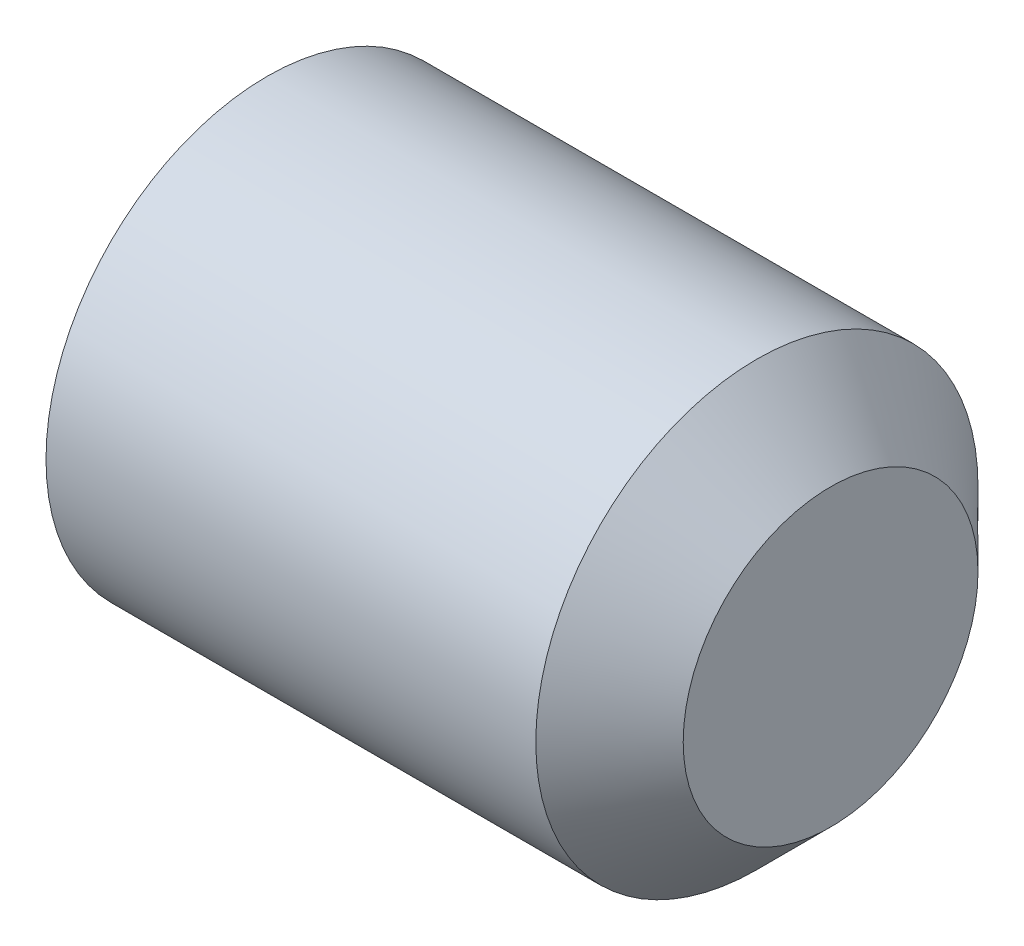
ISO-10303-21;
HEADER;
FILE_DESCRIPTION(('STEP AP214'),'2;1');
FILE_NAME('part.step','',(''),(''),'','','');
FILE_SCHEMA(('AUTOMOTIVE_DESIGN { 1 0 10303 214 1 1 1 1 }'));
ENDSEC;
DATA;
#1=APPLICATION_CONTEXT('core data for automotive mechanical design processes');
#2=APPLICATION_PROTOCOL_DEFINITION('international standard','automotive_design',2000,#1);
#3=PRODUCT_CONTEXT('',#1,'mechanical');
#4=PRODUCT('Part','Part','',(#3));
#5=PRODUCT_RELATED_PRODUCT_CATEGORY('part','',(#4));
#6=PRODUCT_DEFINITION_FORMATION('','',#4);
#7=PRODUCT_DEFINITION_CONTEXT('part definition',#1,'design');
#8=PRODUCT_DEFINITION('design','',#6,#7);
#9=PRODUCT_DEFINITION_SHAPE('','',#8);
#10=(LENGTH_UNIT() NAMED_UNIT(*) SI_UNIT(.MILLI.,.METRE.));
#11=(NAMED_UNIT(*) PLANE_ANGLE_UNIT() SI_UNIT($,.RADIAN.));
#12=(NAMED_UNIT(*) SI_UNIT($,.STERADIAN.) SOLID_ANGLE_UNIT());
#13=UNCERTAINTY_MEASURE_WITH_UNIT(LENGTH_MEASURE(1.E-05),#10,'distance_accuracy_value','');
#14=(GEOMETRIC_REPRESENTATION_CONTEXT(3) GLOBAL_UNCERTAINTY_ASSIGNED_CONTEXT((#13)) GLOBAL_UNIT_ASSIGNED_CONTEXT((#10,
#11,#12)) REPRESENTATION_CONTEXT('',''));
#15=CARTESIAN_POINT('',(0.,0.,0.));
#16=DIRECTION('',(0.,0.,1.));
#17=DIRECTION('',(1.,0.,0.));
#18=AXIS2_PLACEMENT_3D('',#15,#16,#17);
#19=CARTESIAN_POINT('',(0.,0.,0.));
#20=DIRECTION('',(-1.,0.,0.));
#21=DIRECTION('',(0.,0.,1.));
#22=AXIS2_PLACEMENT_3D('',#19,#20,#21);
#23=CONICAL_SURFACE('',#22,1.7320508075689,1.0471975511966);
#24=CARTESIAN_POINT('',(-1.48566055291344E-11,-4.45691660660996E-11,1.73205080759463));
#25=CARTESIAN_POINT('',(0.0435225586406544,0.130567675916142,1.65666752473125));
#26=CARTESIAN_POINT('',(0.0790805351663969,0.262596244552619,1.58044079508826));
#27=CARTESIAN_POINT('',(0.126101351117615,0.531650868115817,1.42510203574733));
#28=CARTESIAN_POINT('',(0.136966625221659,0.666918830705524,1.34700504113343));
#29=CARTESIAN_POINT('',(0.13002522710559,0.921354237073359,1.20010669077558));
#30=CARTESIAN_POINT('',(0.115926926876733,1.0388521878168,1.13226921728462));
#31=CARTESIAN_POINT('',(0.0696548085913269,1.2718608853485,0.997741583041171));
#32=CARTESIAN_POINT('',(0.0378293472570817,1.3865119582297,0.93154775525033));
#33=CARTESIAN_POINT('',(-2.64892274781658E-12,1.50000000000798,0.866025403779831));
#34=B_SPLINE_CURVE_WITH_KNOTS('',3,(#24,#25,#26,#27,#28,#29,#30,#31,#32,#33),.UNSPECIFIED.,.F.,
.F.,(4,2,2,2,4),(0.000238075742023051,0.468729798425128,0.937221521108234,1.34337114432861,
1.74952076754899),.UNSPECIFIED.);
#35=CARTESIAN_POINT('',(0.,0.,1.7320508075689));
#36=VERTEX_POINT('',#35);
#37=CARTESIAN_POINT('',(0.,1.5,0.866025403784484));
#38=VERTEX_POINT('',#37);
#39=EDGE_CURVE('E4',#36,#38,#34,.T.);
#40=ORIENTED_EDGE('',*,*,#39,.F.);
#41=CARTESIAN_POINT('',(0.,0.,0.));
#42=DIRECTION('',(-1.,0.,0.));
#43=DIRECTION('',(0.,0.,1.));
#44=AXIS2_PLACEMENT_3D('',#41,#42,#43);
#45=CIRCLE('',#44,1.7320508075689);
#46=EDGE_CURVE('E22',#36,#38,#45,.T.);
#47=ORIENTED_EDGE('',*,*,#46,.T.);
#48=EDGE_LOOP('',(#40,#47));
#49=FACE_BOUND('',#48,.T.);
#50=ADVANCED_FACE('F27',(#49),#23,.F.);
#51=CARTESIAN_POINT('',(-8.51055337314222E-12,-1.50000000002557,0.866025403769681));
#52=CARTESIAN_POINT('',(0.0435225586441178,-1.36943232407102,0.941408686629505));
#53=CARTESIAN_POINT('',(0.0790805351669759,-1.23740375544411,1.01763541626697));
#54=CARTESIAN_POINT('',(0.126101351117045,-0.968349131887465,1.17297417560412));
#55=CARTESIAN_POINT('',(0.13696662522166,-0.833081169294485,1.25107117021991));
#56=CARTESIAN_POINT('',(0.130025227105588,-0.578645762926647,1.39796952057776));
#57=CARTESIAN_POINT('',(0.115926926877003,-0.461147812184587,1.46580699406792));
#58=CARTESIAN_POINT('',(0.0696548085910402,-0.228139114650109,1.60033462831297));
#59=CARTESIAN_POINT('',(0.0378293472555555,-0.113488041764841,1.66652845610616));
#60=CARTESIAN_POINT('',(-5.35986185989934E-12,1.60769959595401E-11,1.73205080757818));
#61=B_SPLINE_CURVE_WITH_KNOTS('',3,(#51,#52,#53,#54,#55,#56,#57,#58,#59,#60),.UNSPECIFIED.,.F.,
.F.,(4,2,2,2,4),(0.000238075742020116,0.468729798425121,0.937221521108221,1.34337114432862,
1.74952076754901),.UNSPECIFIED.);
#62=CARTESIAN_POINT('',(0.,-1.5,0.86602540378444));
#63=VERTEX_POINT('',#62);
#64=EDGE_CURVE('E37',#63,#36,#61,.T.);
#65=ORIENTED_EDGE('',*,*,#64,.F.);
#66=CARTESIAN_POINT('',(0.,0.,0.));
#67=DIRECTION('',(-1.,0.,0.));
#68=DIRECTION('',(0.,-0.866025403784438,0.500000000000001));
#69=AXIS2_PLACEMENT_3D('',#66,#67,#68);
#70=CIRCLE('',#69,1.7320508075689);
#71=EDGE_CURVE('E54',#63,#36,#70,.T.);
#72=ORIENTED_EDGE('',*,*,#71,.T.);
#73=EDGE_LOOP('',(#65,#72));
#74=FACE_BOUND('',#73,.T.);
#75=ADVANCED_FACE('F57',(#74),#23,.F.);
#76=CARTESIAN_POINT('',(-6.69702227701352E-09,-1.5,-0.866025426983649));
#77=CARTESIAN_POINT('',(0.0362442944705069,-1.5,-0.740471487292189));
#78=CARTESIAN_POINT('',(0.0669200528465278,-1.5,-0.614005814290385));
#79=CARTESIAN_POINT('',(0.112772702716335,-1.5,-0.355816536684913));
#80=CARTESIAN_POINT('',(0.12756856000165,-1.5,-0.224922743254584));
#81=CARTESIAN_POINT('',(0.138151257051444,-1.5,0.0694141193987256));
#82=CARTESIAN_POINT('',(0.12829070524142,-1.5,0.231850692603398));
#83=CARTESIAN_POINT('',(0.0931037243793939,-1.5,0.472666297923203));
#84=CARTESIAN_POINT('',(0.0782293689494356,-1.5,0.551613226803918));
#85=CARTESIAN_POINT('',(0.0517420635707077,-1.5,0.670002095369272));
#86=CARTESIAN_POINT('',(0.0422352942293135,-1.5,0.709346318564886));
#87=CARTESIAN_POINT('',(0.0270622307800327,-1.5,0.76820038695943));
#88=CARTESIAN_POINT('',(0.0218485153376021,-1.5,0.787805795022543));
#89=CARTESIAN_POINT('',(0.0138153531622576,-1.5,0.817162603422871));
#90=CARTESIAN_POINT('',(0.0111005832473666,-1.5,0.826945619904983));
#91=CARTESIAN_POINT('',(0.00560150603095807,-1.5,0.846497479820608));
#92=CARTESIAN_POINT('',(0.00281568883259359,-1.5,0.856271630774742));
#93=CARTESIAN_POINT('',(-2.02321907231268E-06,-1.5,0.866032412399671));
#94=B_SPLINE_CURVE_WITH_KNOTS('',3,(#76,#77,#78,#79,#80,#81,#82,#83,#84,#85,#86,#87,#88,#89,#90,
#91,#92,#93),.UNSPECIFIED.,.F.,.F.,(4,2,2,2,2,2,2,2,4),(2.18200322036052,2.57545986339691,
2.9689165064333,3.45728259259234,3.70146563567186,3.82355715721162,3.8846029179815,
3.91512579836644,3.94564867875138),.UNSPECIFIED.);
#95=CARTESIAN_POINT('',(0.,-1.5,-0.86602540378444));
#96=VERTEX_POINT('',#95);
#97=EDGE_CURVE('E63',#96,#63,#94,.T.);
#98=ORIENTED_EDGE('',*,*,#97,.F.);
#99=CARTESIAN_POINT('',(0.,0.,0.));
#100=DIRECTION('',(-1.,0.,0.));
#101=DIRECTION('',(0.,-0.866025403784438,-0.500000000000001));
#102=AXIS2_PLACEMENT_3D('',#99,#100,#101);
#103=CIRCLE('',#102,1.7320508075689);
#104=EDGE_CURVE('E80',#96,#63,#103,.T.);
#105=ORIENTED_EDGE('',*,*,#104,.T.);
#106=EDGE_LOOP('',(#98,#105));
#107=FACE_BOUND('',#106,.T.);
#108=ADVANCED_FACE('F83',(#107),#23,.F.);
#109=CARTESIAN_POINT('',(-8.52096171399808E-12,2.55633188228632E-11,-1.73205080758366));
#110=CARTESIAN_POINT('',(0.0435225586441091,-0.130567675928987,-1.65666752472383));
#111=CARTESIAN_POINT('',(0.0790805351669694,-0.262596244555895,-1.58044079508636));
#112=CARTESIAN_POINT('',(0.126101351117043,-0.531650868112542,-1.42510203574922));
#113=CARTESIAN_POINT('',(0.13696662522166,-0.666918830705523,-1.34700504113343));
#114=CARTESIAN_POINT('',(0.13002522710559,-0.921354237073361,-1.20010669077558));
#115=CARTESIAN_POINT('',(0.115926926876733,-1.0388521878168,-1.13226921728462));
#116=CARTESIAN_POINT('',(0.0696548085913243,-1.27186088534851,-0.997741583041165));
#117=CARTESIAN_POINT('',(0.0378293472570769,-1.38651195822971,-0.931547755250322));
#118=CARTESIAN_POINT('',(-2.6549942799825E-12,-1.500000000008,-0.866025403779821));
#119=B_SPLINE_CURVE_WITH_KNOTS('',3,(#109,#110,#111,#112,#113,#114,#115,#116,#117,#118),
.UNSPECIFIED.,.F.,.F.,(4,2,2,2,4),(0.000238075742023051,0.468729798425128,0.937221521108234,
1.34337114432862,1.74952076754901),.UNSPECIFIED.);
#120=CARTESIAN_POINT('',(0.,0.,-1.7320508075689));
#121=VERTEX_POINT('',#120);
#122=EDGE_CURVE('E89',#121,#96,#119,.T.);
#123=ORIENTED_EDGE('',*,*,#122,.F.);
#124=CARTESIAN_POINT('',(0.,0.,0.));
#125=DIRECTION('',(-1.,0.,0.));
#126=DIRECTION('',(0.,0.,-1.));
#127=AXIS2_PLACEMENT_3D('',#124,#125,#126);
#128=CIRCLE('',#127,1.7320508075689);
#129=EDGE_CURVE('E106',#121,#96,#128,.T.);
#130=ORIENTED_EDGE('',*,*,#129,.T.);
#131=EDGE_LOOP('',(#123,#130));
#132=FACE_BOUND('',#131,.T.);
#133=ADVANCED_FACE('F109',(#132),#23,.F.);
#134=CARTESIAN_POINT('',(-8.51055337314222E-12,1.50000000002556,-0.866025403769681));
#135=CARTESIAN_POINT('',(0.0435225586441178,1.36943232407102,-0.941408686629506));
#136=CARTESIAN_POINT('',(0.0790805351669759,1.23740375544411,-1.01763541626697));
#137=CARTESIAN_POINT('',(0.126101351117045,0.968349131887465,-1.17297417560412));
#138=CARTESIAN_POINT('',(0.13696662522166,0.833081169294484,-1.25107117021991));
#139=CARTESIAN_POINT('',(0.130025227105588,0.578645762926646,-1.39796952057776));
#140=CARTESIAN_POINT('',(0.115926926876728,0.461147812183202,-1.46580699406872));
#141=CARTESIAN_POINT('',(0.0696548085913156,0.228139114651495,-1.60033462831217));
#142=CARTESIAN_POINT('',(0.0378293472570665,0.113488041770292,-1.66652845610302));
#143=CARTESIAN_POINT('',(-2.66713734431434E-12,-7.99926954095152E-12,-1.73205080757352));
#144=B_SPLINE_CURVE_WITH_KNOTS('',3,(#134,#135,#136,#137,#138,#139,#140,#141,#142,#143),
.UNSPECIFIED.,.F.,.F.,(4,2,2,2,4),(0.000238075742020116,0.468729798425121,0.937221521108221,
1.34337114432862,1.74952076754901),.UNSPECIFIED.);
#145=CARTESIAN_POINT('',(0.,1.5,-0.86602540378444));
#146=VERTEX_POINT('',#145);
#147=EDGE_CURVE('E115',#146,#121,#144,.T.);
#148=ORIENTED_EDGE('',*,*,#147,.F.);
#149=CARTESIAN_POINT('',(0.,0.,0.));
#150=DIRECTION('',(-1.,0.,0.));
#151=DIRECTION('',(0.,0.866025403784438,-0.500000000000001));
#152=AXIS2_PLACEMENT_3D('',#149,#150,#151);
#153=CIRCLE('',#152,1.7320508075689);
#154=EDGE_CURVE('E132',#146,#121,#153,.T.);
#155=ORIENTED_EDGE('',*,*,#154,.T.);
#156=EDGE_LOOP('',(#148,#155));
#157=FACE_BOUND('',#156,.T.);
#158=ADVANCED_FACE('F135',(#157),#23,.F.);
#159=CARTESIAN_POINT('',(-6.69703442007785E-09,1.5,0.866025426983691));
#160=CARTESIAN_POINT('',(0.0362442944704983,1.5,0.740471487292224));
#161=CARTESIAN_POINT('',(0.0669200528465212,1.5,0.614005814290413));
#162=CARTESIAN_POINT('',(0.112772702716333,1.5,0.355816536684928));
#163=CARTESIAN_POINT('',(0.12756856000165,1.5,0.224922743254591));
#164=CARTESIAN_POINT('',(0.138151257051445,1.5,-0.0694141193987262));
#165=CARTESIAN_POINT('',(0.12829070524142,1.5,-0.231850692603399));
#166=CARTESIAN_POINT('',(0.0931037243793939,1.5,-0.472666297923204));
#167=CARTESIAN_POINT('',(0.0782293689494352,1.5,-0.551613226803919));
#168=CARTESIAN_POINT('',(0.0517420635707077,1.5,-0.670002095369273));
#169=CARTESIAN_POINT('',(0.0422352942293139,1.5,-0.709346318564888));
#170=CARTESIAN_POINT('',(0.0270622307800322,1.5,-0.768200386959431));
#171=CARTESIAN_POINT('',(0.0218485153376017,1.5,-0.787805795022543));
#172=CARTESIAN_POINT('',(0.0138153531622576,1.5,-0.817162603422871));
#173=CARTESIAN_POINT('',(0.0111005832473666,1.5,-0.826945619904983));
#174=CARTESIAN_POINT('',(0.00560150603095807,1.5,-0.846497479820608));
#175=CARTESIAN_POINT('',(0.00281568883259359,1.5,-0.856271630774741));
#176=CARTESIAN_POINT('',(-2.02321907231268E-06,1.5,-0.86603241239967));
#177=B_SPLINE_CURVE_WITH_KNOTS('',3,(#159,#160,#161,#162,#163,#164,#165,#166,#167,#168,#169,
#170,#171,#172,#173,#174,#175,#176),.UNSPECIFIED.,.F.,.F.,(4,2,2,2,2,2,2,2,4),(2.18200322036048,
2.57545986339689,2.9689165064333,3.45728259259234,3.70146563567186,3.82355715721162,
3.8846029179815,3.91512579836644,3.94564867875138),.UNSPECIFIED.);
#178=EDGE_CURVE('E141',#38,#146,#177,.T.);
#179=ORIENTED_EDGE('',*,*,#178,.F.);
#180=CARTESIAN_POINT('',(0.,0.,0.));
#181=DIRECTION('',(-1.,0.,0.));
#182=DIRECTION('',(0.,0.866025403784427,0.50000000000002));
#183=AXIS2_PLACEMENT_3D('',#180,#181,#182);
#184=CIRCLE('',#183,1.7320508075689);
#185=EDGE_CURVE('E156',#38,#146,#184,.T.);
#186=ORIENTED_EDGE('',*,*,#185,.T.);
#187=EDGE_LOOP('',(#179,#186));
#188=FACE_BOUND('',#187,.T.);
#189=ADVANCED_FACE('F159',(#188),#23,.F.);
#190=CARTESIAN_POINT('',(8.,0.,0.));
#191=DIRECTION('',(-1.,0.,0.));
#192=DIRECTION('',(0.,0.,1.));
#193=AXIS2_PLACEMENT_3D('',#190,#191,#192);
#194=PLANE('',#193);
#195=CARTESIAN_POINT('',(8.,0.,0.));
#196=DIRECTION('',(-1.,0.,0.));
#197=DIRECTION('',(0.,0.,1.));
#198=AXIS2_PLACEMENT_3D('',#195,#196,#197);
#199=CIRCLE('',#198,2.);
#200=CARTESIAN_POINT('',(8.,0.,2.));
#201=VERTEX_POINT('',#200);
#202=EDGE_CURVE('E166',#201,#201,#199,.T.);
#203=ORIENTED_EDGE('',*,*,#202,.F.);
#204=EDGE_LOOP('',(#203));
#205=FACE_BOUND('',#204,.T.);
#206=ADVANCED_FACE('F170',(#205),#194,.F.);
#207=CARTESIAN_POINT('',(8.,0.,0.));
#208=DIRECTION('',(-1.,0.,0.));
#209=DIRECTION('',(0.,0.,1.));
#210=AXIS2_PLACEMENT_3D('',#207,#208,#209);
#211=CONICAL_SURFACE('',#210,2.,0.785398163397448);
#212=CARTESIAN_POINT('',(7.,0.,0.));
#213=DIRECTION('',(-1.,0.,0.));
#214=DIRECTION('',(0.,0.,1.));
#215=AXIS2_PLACEMENT_3D('',#212,#213,#214);
#216=CIRCLE('',#215,3.);
#217=CARTESIAN_POINT('',(7.,0.,3.));
#218=VERTEX_POINT('',#217);
#219=EDGE_CURVE('E177',#218,#218,#216,.T.);
#220=ORIENTED_EDGE('',*,*,#219,.F.);
#221=EDGE_LOOP('',(#220));
#222=FACE_BOUND('',#221,.T.);
#223=ORIENTED_EDGE('',*,*,#202,.T.);
#224=EDGE_LOOP('',(#223));
#225=FACE_BOUND('',#224,.T.);
#226=ADVANCED_FACE('F183',(#222,#225),#211,.T.);
#227=CARTESIAN_POINT('',(1.,0.,0.));
#228=DIRECTION('',(-1.,0.,0.));
#229=DIRECTION('',(0.,0.,1.));
#230=AXIS2_PLACEMENT_3D('',#227,#228,#229);
#231=CYLINDRICAL_SURFACE('',#230,3.);
#232=CARTESIAN_POINT('',(0.354204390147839,0.,0.));
#233=DIRECTION('',(-1.,0.,0.));
#234=DIRECTION('',(0.,0.,1.));
#235=AXIS2_PLACEMENT_3D('',#232,#233,#234);
#236=CIRCLE('',#235,3.);
#237=CARTESIAN_POINT('',(0.354204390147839,0.,3.));
#238=VERTEX_POINT('',#237);
#239=EDGE_CURVE('E190',#238,#238,#236,.T.);
#240=ORIENTED_EDGE('',*,*,#239,.F.);
#241=EDGE_LOOP('',(#240));
#242=FACE_BOUND('',#241,.T.);
#243=ORIENTED_EDGE('',*,*,#219,.T.);
#244=EDGE_LOOP('',(#243));
#245=FACE_BOUND('',#244,.T.);
#246=ADVANCED_FACE('F196',(#242,#245),#231,.T.);
#247=CARTESIAN_POINT('',(0.354204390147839,0.,0.));
#248=DIRECTION('',(1.,0.,0.));
#249=DIRECTION('',(0.,0.,-1.));
#250=AXIS2_PLACEMENT_3D('',#247,#248,#249);
#251=CONICAL_SURFACE('',#250,3.,1.0471975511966);
#252=CARTESIAN_POINT('',(0.,0.,0.));
#253=DIRECTION('',(-1.,0.,0.));
#254=DIRECTION('',(0.,0.,1.));
#255=AXIS2_PLACEMENT_3D('',#252,#253,#254);
#256=CIRCLE('',#255,2.38649999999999);
#257=CARTESIAN_POINT('',(0.,0.,2.38649999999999));
#258=VERTEX_POINT('',#257);
#259=EDGE_CURVE('E203',#258,#258,#256,.T.);
#260=ORIENTED_EDGE('',*,*,#259,.F.);
#261=EDGE_LOOP('',(#260));
#262=FACE_BOUND('',#261,.T.);
#263=ORIENTED_EDGE('',*,*,#239,.T.);
#264=EDGE_LOOP('',(#263));
#265=FACE_BOUND('',#264,.T.);
#266=ADVANCED_FACE('F209',(#262,#265),#251,.T.);
#267=CARTESIAN_POINT('',(0.,-2.3865,0.));
#268=DIRECTION('',(1.,0.,0.));
#269=DIRECTION('',(0.,0.,-1.));
#270=AXIS2_PLACEMENT_3D('',#267,#268,#269);
#271=PLANE('',#270);
#272=ORIENTED_EDGE('',*,*,#46,.F.);
#273=ORIENTED_EDGE('',*,*,#71,.F.);
#274=ORIENTED_EDGE('',*,*,#104,.F.);
#275=ORIENTED_EDGE('',*,*,#129,.F.);
#276=ORIENTED_EDGE('',*,*,#154,.F.);
#277=ORIENTED_EDGE('',*,*,#185,.F.);
#278=EDGE_LOOP('',(#272,#273,#274,#275,#276,#277));
#279=FACE_BOUND('',#278,.T.);
#280=ORIENTED_EDGE('',*,*,#259,.T.);
#281=EDGE_LOOP('',(#280));
#282=FACE_BOUND('',#281,.T.);
#283=ADVANCED_FACE('F225',(#279,#282),#271,.F.);
#284=CARTESIAN_POINT('',(3.5,1.5,0.86602540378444));
#285=DIRECTION('',(0.,-0.500000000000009,-0.866025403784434));
#286=DIRECTION('',(0.,0.866025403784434,-0.500000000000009));
#287=AXIS2_PLACEMENT_3D('',#284,#285,#286);
#288=PLANE('',#287);
#289=ORIENTED_EDGE('',*,*,#39,.T.);
#290=DIRECTION('',(-1.,0.,0.));
#291=VECTOR('',#290,1.);
#292=CARTESIAN_POINT('',(3.5,1.5,0.86602540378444));
#293=LINE('',#292,#291);
#294=CARTESIAN_POINT('',(3.5,1.5,0.86602540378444));
#295=VERTEX_POINT('',#294);
#296=EDGE_CURVE('E246',#295,#38,#293,.T.);
#297=ORIENTED_EDGE('',*,*,#296,.F.);
#298=DIRECTION('',(0.,-0.866025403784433,0.500000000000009));
#299=VECTOR('',#298,1.);
#300=CARTESIAN_POINT('',(3.5,1.5,0.86602540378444));
#301=LINE('',#300,#299);
#302=CARTESIAN_POINT('',(3.5,0.,1.7320508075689));
#303=VERTEX_POINT('',#302);
#304=EDGE_CURVE('E253',#295,#303,#301,.T.);
#305=ORIENTED_EDGE('',*,*,#304,.T.);
#306=DIRECTION('',(-1.,0.,0.));
#307=VECTOR('',#306,1.);
#308=CARTESIAN_POINT('',(3.5,0.,1.7320508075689));
#309=LINE('',#308,#307);
#310=EDGE_CURVE('E260',#303,#36,#309,.T.);
#311=ORIENTED_EDGE('',*,*,#310,.T.);
#312=EDGE_LOOP('',(#289,#297,#305,#311));
#313=FACE_BOUND('',#312,.T.);
#314=ADVANCED_FACE('F263',(#313),#288,.T.);
#315=CARTESIAN_POINT('',(3.5,0.,1.7320508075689));
#316=DIRECTION('',(0.,0.500000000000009,-0.866025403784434));
#317=DIRECTION('',(0.,0.866025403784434,0.500000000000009));
#318=AXIS2_PLACEMENT_3D('',#315,#316,#317);
#319=PLANE('',#318);
#320=ORIENTED_EDGE('',*,*,#64,.T.);
#321=ORIENTED_EDGE('',*,*,#310,.F.);
#322=DIRECTION('',(0.,-0.866025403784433,-0.500000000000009));
#323=VECTOR('',#322,1.);
#324=CARTESIAN_POINT('',(3.5,0.,1.7320508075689));
#325=LINE('',#324,#323);
#326=CARTESIAN_POINT('',(3.5,-1.5,0.86602540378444));
#327=VERTEX_POINT('',#326);
#328=EDGE_CURVE('E285',#303,#327,#325,.T.);
#329=ORIENTED_EDGE('',*,*,#328,.T.);
#330=DIRECTION('',(-1.,0.,0.));
#331=VECTOR('',#330,1.);
#332=CARTESIAN_POINT('',(3.5,-1.5,0.86602540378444));
#333=LINE('',#332,#331);
#334=EDGE_CURVE('E292',#327,#63,#333,.T.);
#335=ORIENTED_EDGE('',*,*,#334,.T.);
#336=EDGE_LOOP('',(#320,#321,#329,#335));
#337=FACE_BOUND('',#336,.T.);
#338=ADVANCED_FACE('F295',(#337),#319,.T.);
#339=CARTESIAN_POINT('',(3.5,-1.5,0.86602540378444));
#340=DIRECTION('',(0.,1.,0.));
#341=DIRECTION('',(0.,0.,1.));
#342=AXIS2_PLACEMENT_3D('',#339,#340,#341);
#343=PLANE('',#342);
#344=ORIENTED_EDGE('',*,*,#97,.T.);
#345=ORIENTED_EDGE('',*,*,#334,.F.);
#346=DIRECTION('',(0.,0.,-1.));
#347=VECTOR('',#346,1.);
#348=CARTESIAN_POINT('',(3.5,-1.5,0.86602540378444));
#349=LINE('',#348,#347);
#350=CARTESIAN_POINT('',(3.5,-1.5,-0.86602540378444));
#351=VERTEX_POINT('',#350);
#352=EDGE_CURVE('E317',#327,#351,#349,.T.);
#353=ORIENTED_EDGE('',*,*,#352,.T.);
#354=DIRECTION('',(-1.,0.,0.));
#355=VECTOR('',#354,1.);
#356=CARTESIAN_POINT('',(3.5,-1.5,-0.86602540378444));
#357=LINE('',#356,#355);
#358=EDGE_CURVE('E324',#351,#96,#357,.T.);
#359=ORIENTED_EDGE('',*,*,#358,.T.);
#360=EDGE_LOOP('',(#344,#345,#353,#359));
#361=FACE_BOUND('',#360,.T.);
#362=ADVANCED_FACE('F327',(#361),#343,.T.);
#363=CARTESIAN_POINT('',(3.5,-1.5,-0.86602540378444));
#364=DIRECTION('',(0.,0.500000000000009,0.866025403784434));
#365=DIRECTION('',(0.,-0.866025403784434,0.500000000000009));
#366=AXIS2_PLACEMENT_3D('',#363,#364,#365);
#367=PLANE('',#366);
#368=ORIENTED_EDGE('',*,*,#122,.T.);
#369=ORIENTED_EDGE('',*,*,#358,.F.);
#370=DIRECTION('',(0.,0.866025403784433,-0.500000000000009));
#371=VECTOR('',#370,1.);
#372=CARTESIAN_POINT('',(3.5,-1.5,-0.86602540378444));
#373=LINE('',#372,#371);
#374=CARTESIAN_POINT('',(3.5,0.,-1.7320508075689));
#375=VERTEX_POINT('',#374);
#376=EDGE_CURVE('E349',#351,#375,#373,.T.);
#377=ORIENTED_EDGE('',*,*,#376,.T.);
#378=DIRECTION('',(-1.,0.,0.));
#379=VECTOR('',#378,1.);
#380=CARTESIAN_POINT('',(3.5,0.,-1.7320508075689));
#381=LINE('',#380,#379);
#382=EDGE_CURVE('E356',#375,#121,#381,.T.);
#383=ORIENTED_EDGE('',*,*,#382,.T.);
#384=EDGE_LOOP('',(#368,#369,#377,#383));
#385=FACE_BOUND('',#384,.T.);
#386=ADVANCED_FACE('F359',(#385),#367,.T.);
#387=CARTESIAN_POINT('',(3.5,0.,-1.7320508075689));
#388=DIRECTION('',(0.,-0.500000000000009,0.866025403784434));
#389=DIRECTION('',(0.,-0.866025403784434,-0.500000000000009));
#390=AXIS2_PLACEMENT_3D('',#387,#388,#389);
#391=PLANE('',#390);
#392=ORIENTED_EDGE('',*,*,#147,.T.);
#393=ORIENTED_EDGE('',*,*,#382,.F.);
#394=DIRECTION('',(0.,0.866025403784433,0.500000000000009));
#395=VECTOR('',#394,1.);
#396=CARTESIAN_POINT('',(3.5,0.,-1.7320508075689));
#397=LINE('',#396,#395);
#398=CARTESIAN_POINT('',(3.5,1.5,-0.86602540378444));
#399=VERTEX_POINT('',#398);
#400=EDGE_CURVE('E381',#375,#399,#397,.T.);
#401=ORIENTED_EDGE('',*,*,#400,.T.);
#402=DIRECTION('',(-1.,0.,0.));
#403=VECTOR('',#402,1.);
#404=CARTESIAN_POINT('',(3.5,1.5,-0.86602540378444));
#405=LINE('',#404,#403);
#406=EDGE_CURVE('E388',#399,#146,#405,.T.);
#407=ORIENTED_EDGE('',*,*,#406,.T.);
#408=EDGE_LOOP('',(#392,#393,#401,#407));
#409=FACE_BOUND('',#408,.T.);
#410=ADVANCED_FACE('F391',(#409),#391,.T.);
#411=CARTESIAN_POINT('',(3.5,1.5,-0.86602540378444));
#412=DIRECTION('',(0.,-1.,0.));
#413=DIRECTION('',(0.,0.,-1.));
#414=AXIS2_PLACEMENT_3D('',#411,#412,#413);
#415=PLANE('',#414);
#416=ORIENTED_EDGE('',*,*,#178,.T.);
#417=ORIENTED_EDGE('',*,*,#406,.F.);
#418=DIRECTION('',(0.,0.,1.));
#419=VECTOR('',#418,1.);
#420=CARTESIAN_POINT('',(3.5,1.5,-0.86602540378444));
#421=LINE('',#420,#419);
#422=EDGE_CURVE('E413',#399,#295,#421,.T.);
#423=ORIENTED_EDGE('',*,*,#422,.T.);
#424=ORIENTED_EDGE('',*,*,#296,.T.);
#425=EDGE_LOOP('',(#416,#417,#423,#424));
#426=FACE_BOUND('',#425,.T.);
#427=ADVANCED_FACE('F417',(#426),#415,.T.);
#428=CARTESIAN_POINT('',(3.5,0.,0.));
#429=DIRECTION('',(1.,0.,0.));
#430=DIRECTION('',(0.,0.,-1.));
#431=AXIS2_PLACEMENT_3D('',#428,#429,#430);
#432=PLANE('',#431);
#433=ORIENTED_EDGE('',*,*,#304,.F.);
#434=ORIENTED_EDGE('',*,*,#422,.F.);
#435=ORIENTED_EDGE('',*,*,#400,.F.);
#436=ORIENTED_EDGE('',*,*,#376,.F.);
#437=ORIENTED_EDGE('',*,*,#352,.F.);
#438=ORIENTED_EDGE('',*,*,#328,.F.);
#439=EDGE_LOOP('',(#433,#434,#435,#436,#437,#438));
#440=FACE_BOUND('',#439,.T.);
#441=ADVANCED_FACE('F431',(#440),#432,.F.);
#442=CLOSED_SHELL('',(#50,#75,#108,#133,#158,#189,#206,#226,#246,#266,#283,#314,#338,#362,#386,
#410,#427,#441));
#443=MANIFOLD_SOLID_BREP('B1',#442);
#444=ADVANCED_BREP_SHAPE_REPRESENTATION('',(#18,#443),#14);
#445=SHAPE_DEFINITION_REPRESENTATION(#9,#444);
ENDSEC;
END-ISO-10303-21;
